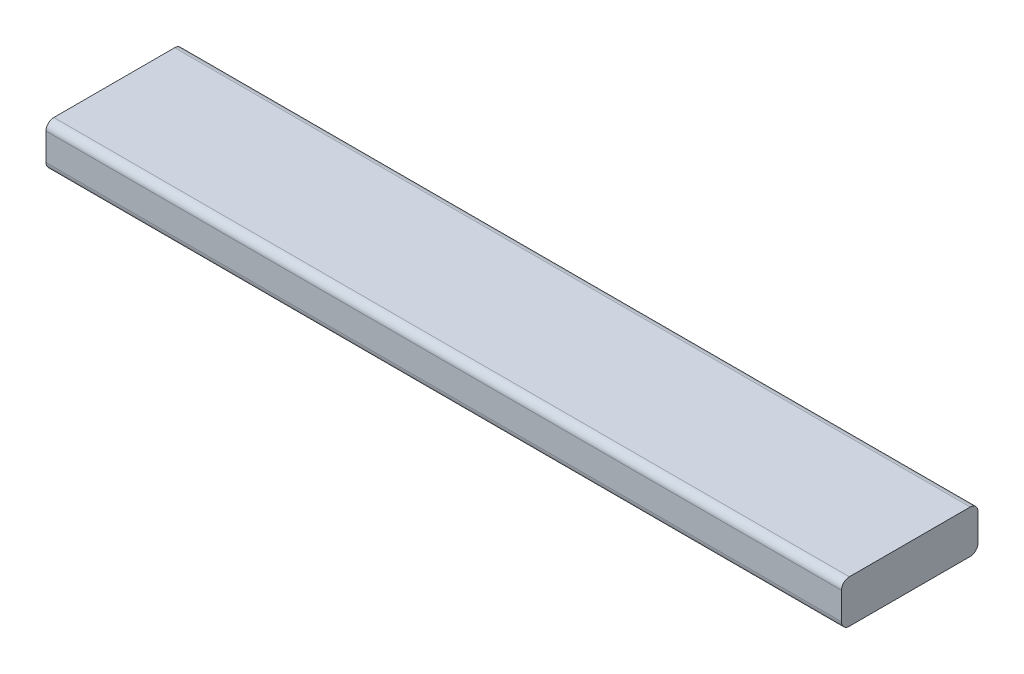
ISO-10303-21;
HEADER;
FILE_DESCRIPTION(('STEP AP214'),'2;1');
FILE_NAME('part.step','',(''),(''),'','','');
FILE_SCHEMA(('AUTOMOTIVE_DESIGN { 1 0 10303 214 1 1 1 1 }'));
ENDSEC;
DATA;
#1=APPLICATION_CONTEXT('core data for automotive mechanical design processes');
#2=APPLICATION_PROTOCOL_DEFINITION('international standard','automotive_design',2000,#1);
#3=PRODUCT_CONTEXT('',#1,'mechanical');
#4=PRODUCT('Part','Part','',(#3));
#5=PRODUCT_RELATED_PRODUCT_CATEGORY('part','',(#4));
#6=PRODUCT_DEFINITION_FORMATION('','',#4);
#7=PRODUCT_DEFINITION_CONTEXT('part definition',#1,'design');
#8=PRODUCT_DEFINITION('design','',#6,#7);
#9=PRODUCT_DEFINITION_SHAPE('','',#8);
#10=(LENGTH_UNIT() NAMED_UNIT(*) SI_UNIT(.MILLI.,.METRE.));
#11=(NAMED_UNIT(*) PLANE_ANGLE_UNIT() SI_UNIT($,.RADIAN.));
#12=(NAMED_UNIT(*) SI_UNIT($,.STERADIAN.) SOLID_ANGLE_UNIT());
#13=UNCERTAINTY_MEASURE_WITH_UNIT(LENGTH_MEASURE(1.E-05),#10,'distance_accuracy_value','');
#14=(GEOMETRIC_REPRESENTATION_CONTEXT(3) GLOBAL_UNCERTAINTY_ASSIGNED_CONTEXT((#13)) GLOBAL_UNIT_ASSIGNED_CONTEXT((#10,
#11,#12)) REPRESENTATION_CONTEXT('',''));
#15=CARTESIAN_POINT('',(0.,0.,0.));
#16=DIRECTION('',(0.,0.,1.));
#17=DIRECTION('',(1.,0.,0.));
#18=AXIS2_PLACEMENT_3D('',#15,#16,#17);
#19=CARTESIAN_POINT('',(764.18399568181,0.,0.));
#20=DIRECTION('',(0.,0.,1.));
#21=DIRECTION('',(1.,0.,0.));
#22=AXIS2_PLACEMENT_3D('',#19,#20,#21);
#23=PLANE('',#22);
#24=DIRECTION('',(0.,1.,0.));
#25=VECTOR('',#24,1.);
#26=CARTESIAN_POINT('',(0.,0.,0.));
#27=LINE('',#26,#25);
#28=CARTESIAN_POINT('',(0.,6.35,0.));
#29=VERTEX_POINT('',#28);
#30=CARTESIAN_POINT('',(0.,28.575,0.));
#31=VERTEX_POINT('',#30);
#32=EDGE_CURVE('E175',#29,#31,#27,.T.);
#33=ORIENTED_EDGE('',*,*,#32,.T.);
#34=DIRECTION('',(-1.,0.,0.));
#35=VECTOR('',#34,1.);
#36=CARTESIAN_POINT('',(764.18399568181,28.575,0.));
#37=LINE('',#36,#35);
#38=CARTESIAN_POINT('',(647.7,28.575,0.));
#39=VERTEX_POINT('',#38);
#40=EDGE_CURVE('E56',#31,#39,#37,.F.);
#41=ORIENTED_EDGE('',*,*,#40,.T.);
#42=DIRECTION('',(0.,1.,0.));
#43=VECTOR('',#42,1.);
#44=CARTESIAN_POINT('',(647.7,0.,0.));
#45=LINE('',#44,#43);
#46=CARTESIAN_POINT('',(647.7,6.35,0.));
#47=VERTEX_POINT('',#46);
#48=EDGE_CURVE('E169',#47,#39,#45,.T.);
#49=ORIENTED_EDGE('',*,*,#48,.F.);
#50=DIRECTION('',(-1.,0.,0.));
#51=VECTOR('',#50,1.);
#52=CARTESIAN_POINT('',(764.18399568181,6.35,0.));
#53=LINE('',#52,#51);
#54=EDGE_CURVE('E117',#47,#29,#53,.T.);
#55=ORIENTED_EDGE('',*,*,#54,.T.);
#56=EDGE_LOOP('',(#33,#41,#49,#55));
#57=FACE_BOUND('',#56,.T.);
#58=ADVANCED_FACE('F41',(#57),#23,.F.);
#59=CARTESIAN_POINT('',(764.18399568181,34.925,0.));
#60=DIRECTION('',(0.,-1.,0.));
#61=DIRECTION('',(0.,0.,-1.));
#62=AXIS2_PLACEMENT_3D('',#59,#60,#61);
#63=PLANE('',#62);
#64=DIRECTION('',(0.,0.,1.));
#65=VECTOR('',#64,1.);
#66=CARTESIAN_POINT('',(0.,34.925,0.));
#67=LINE('',#66,#65);
#68=CARTESIAN_POINT('',(0.,34.925,6.35));
#69=VERTEX_POINT('',#68);
#70=CARTESIAN_POINT('',(0.,34.925,104.775));
#71=VERTEX_POINT('',#70);
#72=EDGE_CURVE('E170',#69,#71,#67,.T.);
#73=ORIENTED_EDGE('',*,*,#72,.T.);
#74=DIRECTION('',(-1.,0.,0.));
#75=VECTOR('',#74,1.);
#76=CARTESIAN_POINT('',(764.18399568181,34.925,104.775));
#77=LINE('',#76,#75);
#78=CARTESIAN_POINT('',(647.7,34.925,104.775));
#79=VERTEX_POINT('',#78);
#80=EDGE_CURVE('E145',#71,#79,#77,.F.);
#81=ORIENTED_EDGE('',*,*,#80,.T.);
#82=DIRECTION('',(0.,0.,1.));
#83=VECTOR('',#82,1.);
#84=CARTESIAN_POINT('',(647.7,34.925,0.));
#85=LINE('',#84,#83);
#86=CARTESIAN_POINT('',(647.7,34.925,6.35));
#87=VERTEX_POINT('',#86);
#88=EDGE_CURVE('E113',#87,#79,#85,.T.);
#89=ORIENTED_EDGE('',*,*,#88,.F.);
#90=DIRECTION('',(-1.,0.,0.));
#91=VECTOR('',#90,1.);
#92=CARTESIAN_POINT('',(764.18399568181,34.925,6.35));
#93=LINE('',#92,#91);
#94=EDGE_CURVE('E142',#87,#69,#93,.T.);
#95=ORIENTED_EDGE('',*,*,#94,.T.);
#96=EDGE_LOOP('',(#73,#81,#89,#95));
#97=FACE_BOUND('',#96,.T.);
#98=ADVANCED_FACE('F185',(#97),#63,.F.);
#99=CARTESIAN_POINT('',(764.18399568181,0.,111.125));
#100=DIRECTION('',(0.,0.,-1.));
#101=DIRECTION('',(-1.,0.,0.));
#102=AXIS2_PLACEMENT_3D('',#99,#100,#101);
#103=PLANE('',#102);
#104=DIRECTION('',(0.,-1.,0.));
#105=VECTOR('',#104,1.);
#106=CARTESIAN_POINT('',(647.7,0.,111.125));
#107=LINE('',#106,#105);
#108=CARTESIAN_POINT('',(647.7,28.575,111.125));
#109=VERTEX_POINT('',#108);
#110=CARTESIAN_POINT('',(647.7,6.34999999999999,111.125));
#111=VERTEX_POINT('',#110);
#112=EDGE_CURVE('E110',#109,#111,#107,.T.);
#113=ORIENTED_EDGE('',*,*,#112,.F.);
#114=DIRECTION('',(-1.,0.,0.));
#115=VECTOR('',#114,1.);
#116=CARTESIAN_POINT('',(764.18399568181,28.575,111.125));
#117=LINE('',#116,#115);
#118=CARTESIAN_POINT('',(0.,28.575,111.125));
#119=VERTEX_POINT('',#118);
#120=EDGE_CURVE('E124',#109,#119,#117,.T.);
#121=ORIENTED_EDGE('',*,*,#120,.T.);
#122=DIRECTION('',(0.,-1.,0.));
#123=VECTOR('',#122,1.);
#124=CARTESIAN_POINT('',(0.,0.,111.125));
#125=LINE('',#124,#123);
#126=CARTESIAN_POINT('',(0.,6.34999999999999,111.125));
#127=VERTEX_POINT('',#126);
#128=EDGE_CURVE('E167',#119,#127,#125,.T.);
#129=ORIENTED_EDGE('',*,*,#128,.T.);
#130=DIRECTION('',(-1.,0.,0.));
#131=VECTOR('',#130,1.);
#132=CARTESIAN_POINT('',(764.18399568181,6.34999999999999,111.125));
#133=LINE('',#132,#131);
#134=EDGE_CURVE('E127',#127,#111,#133,.F.);
#135=ORIENTED_EDGE('',*,*,#134,.T.);
#136=EDGE_LOOP('',(#113,#121,#129,#135));
#137=FACE_BOUND('',#136,.T.);
#138=ADVANCED_FACE('F122',(#137),#103,.F.);
#139=CARTESIAN_POINT('',(764.18399568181,0.,0.));
#140=DIRECTION('',(0.,1.,0.));
#141=DIRECTION('',(0.,0.,1.));
#142=AXIS2_PLACEMENT_3D('',#139,#140,#141);
#143=PLANE('',#142);
#144=DIRECTION('',(0.,0.,-1.));
#145=VECTOR('',#144,1.);
#146=CARTESIAN_POINT('',(0.,0.,0.));
#147=LINE('',#146,#145);
#148=CARTESIAN_POINT('',(0.,0.,104.775));
#149=VERTEX_POINT('',#148);
#150=CARTESIAN_POINT('',(0.,0.,6.35));
#151=VERTEX_POINT('',#150);
#152=EDGE_CURVE('E160',#149,#151,#147,.T.);
#153=ORIENTED_EDGE('',*,*,#152,.T.);
#154=DIRECTION('',(-1.,0.,0.));
#155=VECTOR('',#154,1.);
#156=CARTESIAN_POINT('',(764.18399568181,0.,6.35));
#157=LINE('',#156,#155);
#158=CARTESIAN_POINT('',(647.7,0.,6.35));
#159=VERTEX_POINT('',#158);
#160=EDGE_CURVE('E11',#151,#159,#157,.F.);
#161=ORIENTED_EDGE('',*,*,#160,.T.);
#162=DIRECTION('',(0.,0.,-1.));
#163=VECTOR('',#162,1.);
#164=CARTESIAN_POINT('',(647.7,0.,0.));
#165=LINE('',#164,#163);
#166=CARTESIAN_POINT('',(647.7,0.,104.775));
#167=VERTEX_POINT('',#166);
#168=EDGE_CURVE('E162',#167,#159,#165,.T.);
#169=ORIENTED_EDGE('',*,*,#168,.F.);
#170=DIRECTION('',(-1.,0.,0.));
#171=VECTOR('',#170,1.);
#172=CARTESIAN_POINT('',(764.18399568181,0.,104.775));
#173=LINE('',#172,#171);
#174=EDGE_CURVE('E49',#167,#149,#173,.T.);
#175=ORIENTED_EDGE('',*,*,#174,.T.);
#176=EDGE_LOOP('',(#153,#161,#169,#175));
#177=FACE_BOUND('',#176,.T.);
#178=ADVANCED_FACE('F159',(#177),#143,.F.);
#179=CARTESIAN_POINT('',(0.,0.,0.));
#180=DIRECTION('',(1.,0.,0.));
#181=DIRECTION('',(0.,0.,-1.));
#182=AXIS2_PLACEMENT_3D('',#179,#180,#181);
#183=PLANE('',#182);
#184=ORIENTED_EDGE('',*,*,#128,.F.);
#185=CARTESIAN_POINT('',(0.,28.575,104.775));
#186=DIRECTION('',(1.,0.,0.));
#187=DIRECTION('',(0.,0.,-1.));
#188=AXIS2_PLACEMENT_3D('',#185,#186,#187);
#189=CIRCLE('',#188,6.35);
#190=EDGE_CURVE('E130',#119,#71,#189,.F.);
#191=ORIENTED_EDGE('',*,*,#190,.T.);
#192=ORIENTED_EDGE('',*,*,#72,.F.);
#193=CARTESIAN_POINT('',(0.,28.575,6.35));
#194=DIRECTION('',(1.,0.,0.));
#195=DIRECTION('',(0.,0.,-1.));
#196=AXIS2_PLACEMENT_3D('',#193,#194,#195);
#197=CIRCLE('',#196,6.35);
#198=EDGE_CURVE('E139',#69,#31,#197,.F.);
#199=ORIENTED_EDGE('',*,*,#198,.T.);
#200=ORIENTED_EDGE('',*,*,#32,.F.);
#201=CARTESIAN_POINT('',(0.,6.35,6.35));
#202=DIRECTION('',(1.,0.,0.));
#203=DIRECTION('',(0.,0.,-1.));
#204=AXIS2_PLACEMENT_3D('',#201,#202,#203);
#205=CIRCLE('',#204,6.35);
#206=EDGE_CURVE('E133',#29,#151,#205,.F.);
#207=ORIENTED_EDGE('',*,*,#206,.T.);
#208=ORIENTED_EDGE('',*,*,#152,.F.);
#209=CARTESIAN_POINT('',(0.,6.34999999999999,104.775));
#210=DIRECTION('',(1.,0.,0.));
#211=DIRECTION('',(0.,0.,-1.));
#212=AXIS2_PLACEMENT_3D('',#209,#210,#211);
#213=CIRCLE('',#212,6.35);
#214=EDGE_CURVE('E131',#149,#127,#213,.F.);
#215=ORIENTED_EDGE('',*,*,#214,.T.);
#216=EDGE_LOOP('',(#184,#191,#192,#199,#200,#207,#208,#215));
#217=FACE_BOUND('',#216,.T.);
#218=ADVANCED_FACE('F165',(#217),#183,.F.);
#219=CARTESIAN_POINT('',(647.7,0.,0.));
#220=DIRECTION('',(1.,0.,0.));
#221=DIRECTION('',(0.,0.,-1.));
#222=AXIS2_PLACEMENT_3D('',#219,#220,#221);
#223=PLANE('',#222);
#224=ORIENTED_EDGE('',*,*,#88,.T.);
#225=CARTESIAN_POINT('',(647.7,28.575,104.775));
#226=DIRECTION('',(1.,0.,0.));
#227=DIRECTION('',(0.,0.,-1.));
#228=AXIS2_PLACEMENT_3D('',#225,#226,#227);
#229=CIRCLE('',#228,6.35);
#230=EDGE_CURVE('E107',#79,#109,#229,.T.);
#231=ORIENTED_EDGE('',*,*,#230,.T.);
#232=ORIENTED_EDGE('',*,*,#112,.T.);
#233=CARTESIAN_POINT('',(647.7,6.34999999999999,104.775));
#234=DIRECTION('',(1.,0.,0.));
#235=DIRECTION('',(0.,0.,-1.));
#236=AXIS2_PLACEMENT_3D('',#233,#234,#235);
#237=CIRCLE('',#236,6.35);
#238=EDGE_CURVE('E147',#111,#167,#237,.T.);
#239=ORIENTED_EDGE('',*,*,#238,.T.);
#240=ORIENTED_EDGE('',*,*,#168,.T.);
#241=CARTESIAN_POINT('',(647.7,6.35,6.35));
#242=DIRECTION('',(1.,0.,0.));
#243=DIRECTION('',(0.,0.,-1.));
#244=AXIS2_PLACEMENT_3D('',#241,#242,#243);
#245=CIRCLE('',#244,6.35);
#246=EDGE_CURVE('E63',#159,#47,#245,.T.);
#247=ORIENTED_EDGE('',*,*,#246,.T.);
#248=ORIENTED_EDGE('',*,*,#48,.T.);
#249=CARTESIAN_POINT('',(647.7,28.575,6.35));
#250=DIRECTION('',(1.,0.,0.));
#251=DIRECTION('',(0.,0.,-1.));
#252=AXIS2_PLACEMENT_3D('',#249,#250,#251);
#253=CIRCLE('',#252,6.35);
#254=EDGE_CURVE('E118',#39,#87,#253,.T.);
#255=ORIENTED_EDGE('',*,*,#254,.T.);
#256=EDGE_LOOP('',(#224,#231,#232,#239,#240,#247,#248,#255));
#257=FACE_BOUND('',#256,.T.);
#258=ADVANCED_FACE('F109',(#257),#223,.T.);
#259=CARTESIAN_POINT('',(764.18399568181,28.575,104.775));
#260=DIRECTION('',(-1.,0.,0.));
#261=DIRECTION('',(0.,0.,1.));
#262=AXIS2_PLACEMENT_3D('',#259,#260,#261);
#263=CYLINDRICAL_SURFACE('',#262,6.35);
#264=ORIENTED_EDGE('',*,*,#230,.F.);
#265=ORIENTED_EDGE('',*,*,#80,.F.);
#266=ORIENTED_EDGE('',*,*,#190,.F.);
#267=ORIENTED_EDGE('',*,*,#120,.F.);
#268=EDGE_LOOP('',(#264,#265,#266,#267));
#269=FACE_BOUND('',#268,.T.);
#270=ADVANCED_FACE('F129',(#269),#263,.T.);
#271=CARTESIAN_POINT('',(764.18399568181,28.575,6.35));
#272=DIRECTION('',(-1.,0.,0.));
#273=DIRECTION('',(0.,0.,1.));
#274=AXIS2_PLACEMENT_3D('',#271,#272,#273);
#275=CYLINDRICAL_SURFACE('',#274,6.35);
#276=ORIENTED_EDGE('',*,*,#254,.F.);
#277=ORIENTED_EDGE('',*,*,#40,.F.);
#278=ORIENTED_EDGE('',*,*,#198,.F.);
#279=ORIENTED_EDGE('',*,*,#94,.F.);
#280=EDGE_LOOP('',(#276,#277,#278,#279));
#281=FACE_BOUND('',#280,.T.);
#282=ADVANCED_FACE('F182',(#281),#275,.T.);
#283=CARTESIAN_POINT('',(764.18399568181,6.35,6.35));
#284=DIRECTION('',(-1.,0.,0.));
#285=DIRECTION('',(0.,0.,1.));
#286=AXIS2_PLACEMENT_3D('',#283,#284,#285);
#287=CYLINDRICAL_SURFACE('',#286,6.35);
#288=ORIENTED_EDGE('',*,*,#246,.F.);
#289=ORIENTED_EDGE('',*,*,#160,.F.);
#290=ORIENTED_EDGE('',*,*,#206,.F.);
#291=ORIENTED_EDGE('',*,*,#54,.F.);
#292=EDGE_LOOP('',(#288,#289,#290,#291));
#293=FACE_BOUND('',#292,.T.);
#294=ADVANCED_FACE('F187',(#293),#287,.T.);
#295=CARTESIAN_POINT('',(764.18399568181,6.34999999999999,104.775));
#296=DIRECTION('',(-1.,0.,0.));
#297=DIRECTION('',(0.,0.,1.));
#298=AXIS2_PLACEMENT_3D('',#295,#296,#297);
#299=CYLINDRICAL_SURFACE('',#298,6.35);
#300=ORIENTED_EDGE('',*,*,#238,.F.);
#301=ORIENTED_EDGE('',*,*,#134,.F.);
#302=ORIENTED_EDGE('',*,*,#214,.F.);
#303=ORIENTED_EDGE('',*,*,#174,.F.);
#304=EDGE_LOOP('',(#300,#301,#302,#303));
#305=FACE_BOUND('',#304,.T.);
#306=ADVANCED_FACE('F43',(#305),#299,.T.);
#307=CLOSED_SHELL('',(#58,#98,#138,#178,#218,#258,#270,#282,#294,#306));
#308=MANIFOLD_SOLID_BREP('B2',#307);
#309=ADVANCED_BREP_SHAPE_REPRESENTATION('',(#18,#308),#14);
#310=SHAPE_DEFINITION_REPRESENTATION(#9,#309);
ENDSEC;
END-ISO-10303-21;
